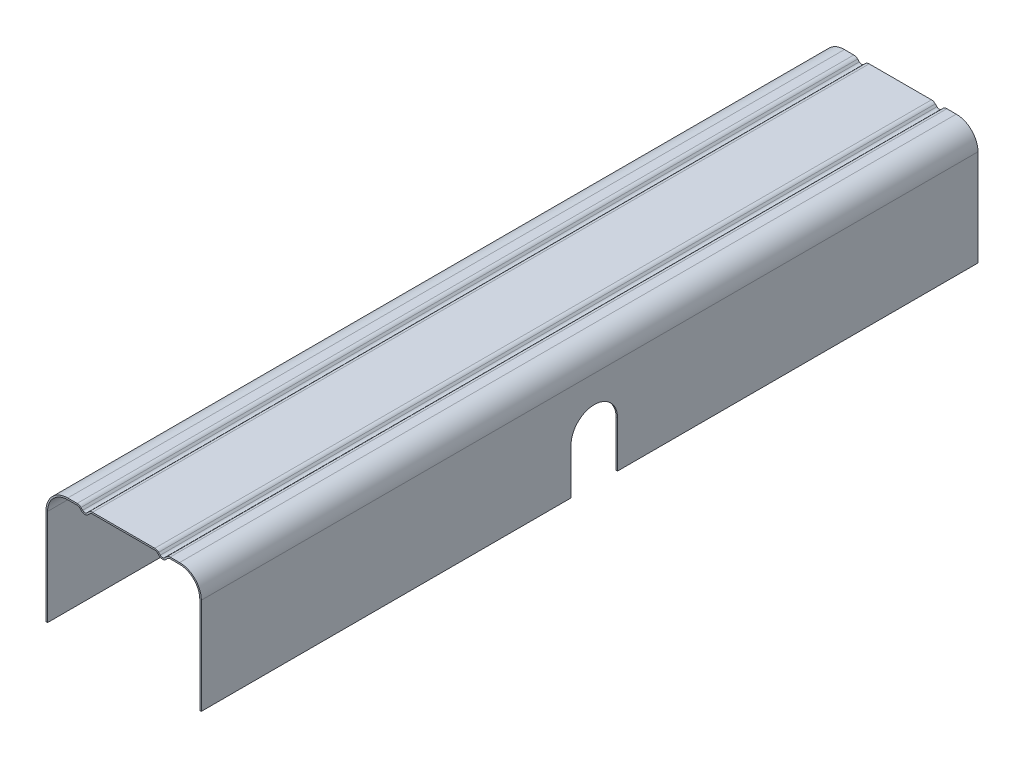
from build123d import *

# Parameters (mm, degrees)
BASE_EXTRU_MINCE_DEPTH  = 500
ENL_V_MAT_EXTRU_1_DEPTH = 513.64900273


with BuildPart() as part:
    # Esquisse1 → Base-Extru.-Mince (new body)
    with BuildSketch(Plane.XY):
        with BuildLine():
            Line((-50, -23), (-50, 39))
            ThreePointArc((-50, 39), (-45.899494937, 48.899494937), (-36, 53))
            Line((-36, 53), (-29.949747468, 53))
            ThreePointArc((-29.949747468, 53), (-28.610355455, 52.733578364), (-27.474873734, 51.974873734))
            Line((-27.474873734, 51.974873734), (-26.414213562, 50.914213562))
            ThreePointArc((-26.414213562, 50.914213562), (-25, 50.328427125), (-23.585786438, 50.914213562))
            Line((-23.585786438, 50.914213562), (-22.525126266, 51.974873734))
            ThreePointArc((-22.525126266, 51.974873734), (-21.389644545, 52.733578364), (-20.050252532, 53))
            Line((-20.050252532, 53), (20.050252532, 53))
            ThreePointArc((20.050252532, 53), (21.389644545, 52.733578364), (22.525126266, 51.974873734))
            Line((22.525126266, 51.974873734), (23.585786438, 50.914213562))
            ThreePointArc((23.585786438, 50.914213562), (25, 50.328427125), (26.414213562, 50.914213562))
            Line((26.414213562, 50.914213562), (27.474873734, 51.974873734))
            ThreePointArc((27.474873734, 51.974873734), (28.610355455, 52.733578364), (29.949747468, 53))
            Line((29.949747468, 53), (36, 53))
            ThreePointArc((36, 53), (45.899494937, 48.899494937), (50, 39))
            Line((50, 39), (50, -23))
            Line((50, -23), (49, -23))
            Line((49, -23), (49, 39))
            ThreePointArc((49, 39), (45.192388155, 48.192388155), (36, 52))
            Line((36, 52), (29.949747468, 52))
            ThreePointArc((29.949747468, 52), (28.993038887, 51.809698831), (28.181980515, 51.267766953))
            Line((28.181980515, 51.267766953), (27.121320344, 50.207106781))
            ThreePointArc((27.121320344, 50.207106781), (25, 49.328427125), (22.878679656, 50.207106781))
            Line((22.878679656, 50.207106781), (21.818019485, 51.267766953))
            ThreePointArc((21.818019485, 51.267766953), (21.006961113, 51.809698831), (20.050252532, 52))
            Line((20.050252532, 52), (-20.050252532, 52))
            ThreePointArc((-20.050252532, 52), (-21.006961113, 51.809698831), (-21.818019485, 51.267766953))
            Line((-21.818019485, 51.267766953), (-22.878679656, 50.207106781))
            ThreePointArc((-22.878679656, 50.207106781), (-25, 49.328427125), (-27.121320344, 50.207106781))
            Line((-27.121320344, 50.207106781), (-28.181980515, 51.267766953))
            ThreePointArc((-28.181980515, 51.267766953), (-28.993038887, 51.809698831), (-29.949747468, 52))
            Line((-29.949747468, 52), (-36, 52))
            ThreePointArc((-36, 52), (-45.192388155, 48.192388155), (-49, 39))
            Line((-49, 39), (-49, -23))
            Line((-49, -23), (-50, -23))
        make_face()
    extrude(amount=BASE_EXTRU_MINCE_DEPTH)

    # Esquisse2 → Enl_v. mat.-Extru.1 (cut, through all)
    with BuildSketch(Plane.ZY.offset(50)):
        with BuildLine():
            Line((262, 6.536504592), (262, -26.464101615))
            Line((262, -26.464101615), (232, -26.464101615))
            Line((232, -26.464101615), (232, 6.536504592))
            ThreePointArc((232, 6.536504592), (247, 21.536504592), (262, 6.536504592))
        make_face()
    extrude(amount=-ENL_V_MAT_EXTRU_1_DEPTH, mode=Mode.SUBTRACT)


solid = part.part
